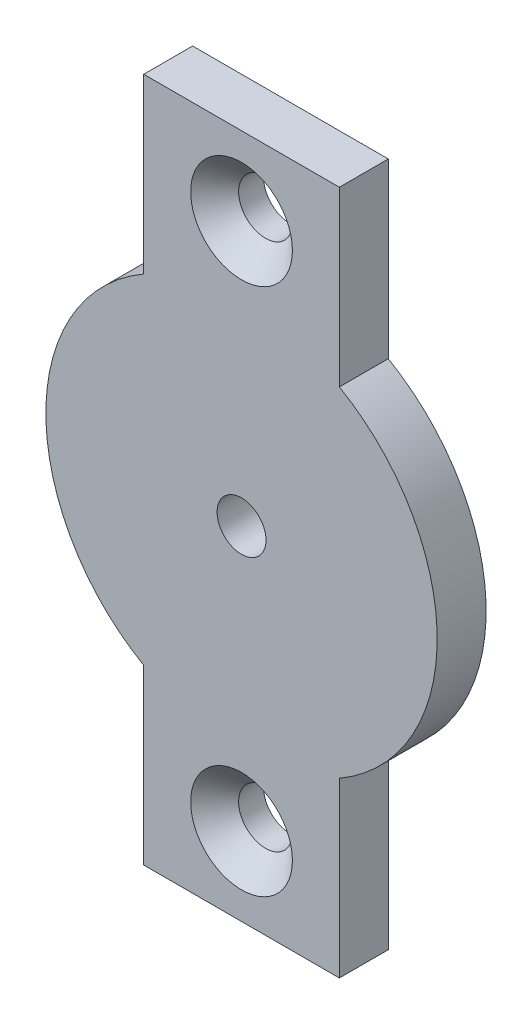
ISO-10303-21;
HEADER;
FILE_DESCRIPTION(('STEP AP214'),'2;1');
FILE_NAME('part.step','',(''),(''),'','','');
FILE_SCHEMA(('AUTOMOTIVE_DESIGN { 1 0 10303 214 1 1 1 1 }'));
ENDSEC;
DATA;
#1=APPLICATION_CONTEXT('core data for automotive mechanical design processes');
#2=APPLICATION_PROTOCOL_DEFINITION('international standard','automotive_design',2000,#1);
#3=PRODUCT_CONTEXT('',#1,'mechanical');
#4=PRODUCT('Part','Part','',(#3));
#5=PRODUCT_RELATED_PRODUCT_CATEGORY('part','',(#4));
#6=PRODUCT_DEFINITION_FORMATION('','',#4);
#7=PRODUCT_DEFINITION_CONTEXT('part definition',#1,'design');
#8=PRODUCT_DEFINITION('design','',#6,#7);
#9=PRODUCT_DEFINITION_SHAPE('','',#8);
#10=(LENGTH_UNIT() NAMED_UNIT(*) SI_UNIT(.MILLI.,.METRE.));
#11=(NAMED_UNIT(*) PLANE_ANGLE_UNIT() SI_UNIT($,.RADIAN.));
#12=(NAMED_UNIT(*) SI_UNIT($,.STERADIAN.) SOLID_ANGLE_UNIT());
#13=UNCERTAINTY_MEASURE_WITH_UNIT(LENGTH_MEASURE(1.E-05),#10,'distance_accuracy_value','');
#14=(GEOMETRIC_REPRESENTATION_CONTEXT(3) GLOBAL_UNCERTAINTY_ASSIGNED_CONTEXT((#13)) GLOBAL_UNIT_ASSIGNED_CONTEXT((#10,
#11,#12)) REPRESENTATION_CONTEXT('',''));
#15=CARTESIAN_POINT('',(0.,0.,0.));
#16=DIRECTION('',(0.,0.,1.));
#17=DIRECTION('',(1.,0.,0.));
#18=AXIS2_PLACEMENT_3D('',#15,#16,#17);
#19=CARTESIAN_POINT('',(0.,0.,5.));
#20=DIRECTION('',(0.,0.,-1.));
#21=DIRECTION('',(-1.,0.,0.));
#22=AXIS2_PLACEMENT_3D('',#19,#20,#21);
#23=CYLINDRICAL_SURFACE('',#22,20.);
#24=DIRECTION('',(0.,0.,1.));
#25=VECTOR('',#24,1.);
#26=CARTESIAN_POINT('',(-10.,-17.3205080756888,0.));
#27=LINE('',#26,#25);
#28=CARTESIAN_POINT('',(-10.,-17.3205080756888,0.));
#29=VERTEX_POINT('',#28);
#30=CARTESIAN_POINT('',(-10.,-17.3205080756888,5.));
#31=VERTEX_POINT('',#30);
#32=EDGE_CURVE('E126',#29,#31,#27,.T.);
#33=ORIENTED_EDGE('',*,*,#32,.T.);
#34=CARTESIAN_POINT('',(0.,0.,5.));
#35=DIRECTION('',(0.,0.,1.));
#36=DIRECTION('',(1.,0.,0.));
#37=AXIS2_PLACEMENT_3D('',#34,#35,#36);
#38=CIRCLE('',#37,20.);
#39=CARTESIAN_POINT('',(-10.,17.3205080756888,5.));
#40=VERTEX_POINT('',#39);
#41=EDGE_CURVE('E11',#40,#31,#38,.T.);
#42=ORIENTED_EDGE('',*,*,#41,.F.);
#43=DIRECTION('',(0.,0.,1.));
#44=VECTOR('',#43,1.);
#45=CARTESIAN_POINT('',(-10.,17.3205080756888,0.));
#46=LINE('',#45,#44);
#47=CARTESIAN_POINT('',(-10.,17.3205080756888,0.));
#48=VERTEX_POINT('',#47);
#49=EDGE_CURVE('E152',#48,#40,#46,.T.);
#50=ORIENTED_EDGE('',*,*,#49,.F.);
#51=CARTESIAN_POINT('',(0.,0.,0.));
#52=DIRECTION('',(0.,0.,1.));
#53=DIRECTION('',(1.,0.,0.));
#54=AXIS2_PLACEMENT_3D('',#51,#52,#53);
#55=CIRCLE('',#54,20.);
#56=EDGE_CURVE('E167',#48,#29,#55,.T.);
#57=ORIENTED_EDGE('',*,*,#56,.T.);
#58=EDGE_LOOP('',(#33,#42,#50,#57));
#59=FACE_BOUND('',#58,.T.);
#60=ADVANCED_FACE('F38',(#59),#23,.T.);
#61=DIRECTION('',(0.,0.,1.));
#62=VECTOR('',#61,1.);
#63=CARTESIAN_POINT('',(10.,-17.3205080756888,0.));
#64=LINE('',#63,#62);
#65=CARTESIAN_POINT('',(10.,-17.3205080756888,0.));
#66=VERTEX_POINT('',#65);
#67=CARTESIAN_POINT('',(10.,-17.3205080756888,5.));
#68=VERTEX_POINT('',#67);
#69=EDGE_CURVE('E140',#66,#68,#64,.T.);
#70=ORIENTED_EDGE('',*,*,#69,.F.);
#71=CARTESIAN_POINT('',(10.,17.3205080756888,0.));
#72=VERTEX_POINT('',#71);
#73=EDGE_CURVE('E160',#66,#72,#55,.T.);
#74=ORIENTED_EDGE('',*,*,#73,.T.);
#75=DIRECTION('',(0.,0.,1.));
#76=VECTOR('',#75,1.);
#77=CARTESIAN_POINT('',(10.,17.3205080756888,0.));
#78=LINE('',#77,#76);
#79=CARTESIAN_POINT('',(10.,17.3205080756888,5.));
#80=VERTEX_POINT('',#79);
#81=EDGE_CURVE('E163',#72,#80,#78,.T.);
#82=ORIENTED_EDGE('',*,*,#81,.T.);
#83=EDGE_CURVE('E46',#68,#80,#38,.T.);
#84=ORIENTED_EDGE('',*,*,#83,.F.);
#85=EDGE_LOOP('',(#70,#74,#82,#84));
#86=FACE_BOUND('',#85,.T.);
#87=ADVANCED_FACE('F195',(#86),#23,.T.);
#88=CARTESIAN_POINT('',(0.,0.,5.));
#89=DIRECTION('',(0.,0.,1.));
#90=DIRECTION('',(1.,0.,0.));
#91=AXIS2_PLACEMENT_3D('',#88,#89,#90);
#92=PLANE('',#91);
#93=CARTESIAN_POINT('',(0.,-27.,5.));
#94=DIRECTION('',(0.,0.,1.));
#95=DIRECTION('',(1.,0.,0.));
#96=AXIS2_PLACEMENT_3D('',#93,#94,#95);
#97=CIRCLE('',#96,5.2);
#98=CARTESIAN_POINT('',(5.20000000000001,-27.,5.));
#99=VERTEX_POINT('',#98);
#100=EDGE_CURVE('E186',#99,#99,#97,.T.);
#101=ORIENTED_EDGE('',*,*,#100,.F.);
#102=EDGE_LOOP('',(#101));
#103=FACE_BOUND('',#102,.T.);
#104=CARTESIAN_POINT('',(0.,27.,5.));
#105=DIRECTION('',(0.,0.,1.));
#106=DIRECTION('',(1.,0.,0.));
#107=AXIS2_PLACEMENT_3D('',#104,#105,#106);
#108=CIRCLE('',#107,5.2);
#109=CARTESIAN_POINT('',(5.2,27.,5.));
#110=VERTEX_POINT('',#109);
#111=EDGE_CURVE('E177',#110,#110,#108,.T.);
#112=ORIENTED_EDGE('',*,*,#111,.F.);
#113=EDGE_LOOP('',(#112));
#114=FACE_BOUND('',#113,.T.);
#115=CARTESIAN_POINT('',(0.,0.,5.));
#116=DIRECTION('',(0.,0.,1.));
#117=DIRECTION('',(1.,0.,0.));
#118=AXIS2_PLACEMENT_3D('',#115,#116,#117);
#119=CIRCLE('',#118,2.5);
#120=CARTESIAN_POINT('',(2.5,0.,5.));
#121=VERTEX_POINT('',#120);
#122=EDGE_CURVE('E131',#121,#121,#119,.T.);
#123=ORIENTED_EDGE('',*,*,#122,.F.);
#124=EDGE_LOOP('',(#123));
#125=FACE_BOUND('',#124,.T.);
#126=ORIENTED_EDGE('',*,*,#41,.T.);
#127=DIRECTION('',(0.,1.,0.));
#128=VECTOR('',#127,1.);
#129=CARTESIAN_POINT('',(-10.,-17.3205080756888,5.));
#130=LINE('',#129,#128);
#131=CARTESIAN_POINT('',(-10.,-35.,5.));
#132=VERTEX_POINT('',#131);
#133=EDGE_CURVE('E135',#132,#31,#130,.T.);
#134=ORIENTED_EDGE('',*,*,#133,.F.);
#135=DIRECTION('',(-1.,0.,0.));
#136=VECTOR('',#135,1.);
#137=CARTESIAN_POINT('',(-10.,-35.,5.));
#138=LINE('',#137,#136);
#139=CARTESIAN_POINT('',(10.,-35.,5.));
#140=VERTEX_POINT('',#139);
#141=EDGE_CURVE('E119',#140,#132,#138,.T.);
#142=ORIENTED_EDGE('',*,*,#141,.F.);
#143=DIRECTION('',(0.,-1.,0.));
#144=VECTOR('',#143,1.);
#145=CARTESIAN_POINT('',(10.,-35.,5.));
#146=LINE('',#145,#144);
#147=EDGE_CURVE('E54',#68,#140,#146,.T.);
#148=ORIENTED_EDGE('',*,*,#147,.F.);
#149=ORIENTED_EDGE('',*,*,#83,.T.);
#150=DIRECTION('',(0.,1.,0.));
#151=VECTOR('',#150,1.);
#152=CARTESIAN_POINT('',(10.,35.,5.));
#153=LINE('',#152,#151);
#154=CARTESIAN_POINT('',(10.,35.,5.));
#155=VERTEX_POINT('',#154);
#156=EDGE_CURVE('E154',#80,#155,#153,.T.);
#157=ORIENTED_EDGE('',*,*,#156,.T.);
#158=DIRECTION('',(-1.,0.,0.));
#159=VECTOR('',#158,1.);
#160=CARTESIAN_POINT('',(-10.,35.,5.));
#161=LINE('',#160,#159);
#162=CARTESIAN_POINT('',(-10.,35.,5.));
#163=VERTEX_POINT('',#162);
#164=EDGE_CURVE('E146',#155,#163,#161,.T.);
#165=ORIENTED_EDGE('',*,*,#164,.T.);
#166=DIRECTION('',(0.,-1.,0.));
#167=VECTOR('',#166,1.);
#168=CARTESIAN_POINT('',(-10.,17.3205080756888,5.));
#169=LINE('',#168,#167);
#170=EDGE_CURVE('E60',#163,#40,#169,.T.);
#171=ORIENTED_EDGE('',*,*,#170,.T.);
#172=EDGE_LOOP('',(#126,#134,#142,#148,#149,#157,#165,#171));
#173=FACE_BOUND('',#172,.T.);
#174=ADVANCED_FACE('F192',(#103,#114,#125,#173),#92,.T.);
#175=CARTESIAN_POINT('',(0.,0.,0.));
#176=DIRECTION('',(0.,0.,1.));
#177=DIRECTION('',(1.,0.,0.));
#178=AXIS2_PLACEMENT_3D('',#175,#176,#177);
#179=PLANE('',#178);
#180=CARTESIAN_POINT('',(0.,-27.,0.));
#181=DIRECTION('',(0.,0.,1.));
#182=DIRECTION('',(1.,0.,0.));
#183=AXIS2_PLACEMENT_3D('',#180,#181,#182);
#184=CIRCLE('',#183,2.75);
#185=CARTESIAN_POINT('',(2.75000000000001,-27.,0.));
#186=VERTEX_POINT('',#185);
#187=EDGE_CURVE('E41',#186,#186,#184,.T.);
#188=ORIENTED_EDGE('',*,*,#187,.T.);
#189=EDGE_LOOP('',(#188));
#190=FACE_BOUND('',#189,.T.);
#191=CARTESIAN_POINT('',(0.,27.,0.));
#192=DIRECTION('',(0.,0.,1.));
#193=DIRECTION('',(1.,0.,0.));
#194=AXIS2_PLACEMENT_3D('',#191,#192,#193);
#195=CIRCLE('',#194,2.75);
#196=CARTESIAN_POINT('',(2.75,27.,0.));
#197=VERTEX_POINT('',#196);
#198=EDGE_CURVE('E170',#197,#197,#195,.T.);
#199=ORIENTED_EDGE('',*,*,#198,.T.);
#200=EDGE_LOOP('',(#199));
#201=FACE_BOUND('',#200,.T.);
#202=CARTESIAN_POINT('',(0.,0.,0.));
#203=DIRECTION('',(0.,0.,1.));
#204=DIRECTION('',(1.,0.,0.));
#205=AXIS2_PLACEMENT_3D('',#202,#203,#204);
#206=CIRCLE('',#205,2.5);
#207=CARTESIAN_POINT('',(2.5,0.,0.));
#208=VERTEX_POINT('',#207);
#209=EDGE_CURVE('E137',#208,#208,#206,.T.);
#210=ORIENTED_EDGE('',*,*,#209,.T.);
#211=EDGE_LOOP('',(#210));
#212=FACE_BOUND('',#211,.T.);
#213=ORIENTED_EDGE('',*,*,#73,.F.);
#214=DIRECTION('',(0.,-1.,0.));
#215=VECTOR('',#214,1.);
#216=CARTESIAN_POINT('',(10.,-35.,0.));
#217=LINE('',#216,#215);
#218=CARTESIAN_POINT('',(10.,-35.,0.));
#219=VERTEX_POINT('',#218);
#220=EDGE_CURVE('E111',#66,#219,#217,.T.);
#221=ORIENTED_EDGE('',*,*,#220,.T.);
#222=DIRECTION('',(-1.,0.,0.));
#223=VECTOR('',#222,1.);
#224=CARTESIAN_POINT('',(-10.,-35.,0.));
#225=LINE('',#224,#223);
#226=CARTESIAN_POINT('',(-10.,-35.,0.));
#227=VERTEX_POINT('',#226);
#228=EDGE_CURVE('E103',#219,#227,#225,.T.);
#229=ORIENTED_EDGE('',*,*,#228,.T.);
#230=DIRECTION('',(0.,1.,0.));
#231=VECTOR('',#230,1.);
#232=CARTESIAN_POINT('',(-10.,-17.3205080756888,0.));
#233=LINE('',#232,#231);
#234=EDGE_CURVE('E109',#227,#29,#233,.T.);
#235=ORIENTED_EDGE('',*,*,#234,.T.);
#236=ORIENTED_EDGE('',*,*,#56,.F.);
#237=DIRECTION('',(0.,-1.,0.));
#238=VECTOR('',#237,1.);
#239=CARTESIAN_POINT('',(-10.,17.3205080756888,0.));
#240=LINE('',#239,#238);
#241=CARTESIAN_POINT('',(-10.,35.,0.));
#242=VERTEX_POINT('',#241);
#243=EDGE_CURVE('E143',#242,#48,#240,.T.);
#244=ORIENTED_EDGE('',*,*,#243,.F.);
#245=DIRECTION('',(-1.,0.,0.));
#246=VECTOR('',#245,1.);
#247=CARTESIAN_POINT('',(-10.,35.,0.));
#248=LINE('',#247,#246);
#249=CARTESIAN_POINT('',(10.,35.,0.));
#250=VERTEX_POINT('',#249);
#251=EDGE_CURVE('E149',#250,#242,#248,.T.);
#252=ORIENTED_EDGE('',*,*,#251,.F.);
#253=DIRECTION('',(0.,1.,0.));
#254=VECTOR('',#253,1.);
#255=CARTESIAN_POINT('',(10.,35.,0.));
#256=LINE('',#255,#254);
#257=EDGE_CURVE('E145',#72,#250,#256,.T.);
#258=ORIENTED_EDGE('',*,*,#257,.F.);
#259=EDGE_LOOP('',(#213,#221,#229,#235,#236,#244,#252,#258));
#260=FACE_BOUND('',#259,.T.);
#261=ADVANCED_FACE('F106',(#190,#201,#212,#260),#179,.F.);
#262=CARTESIAN_POINT('',(-10.,17.3205080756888,0.));
#263=DIRECTION('',(-1.,0.,0.));
#264=DIRECTION('',(0.,0.,1.));
#265=AXIS2_PLACEMENT_3D('',#262,#263,#264);
#266=PLANE('',#265);
#267=ORIENTED_EDGE('',*,*,#170,.F.);
#268=DIRECTION('',(0.,0.,1.));
#269=VECTOR('',#268,1.);
#270=CARTESIAN_POINT('',(-10.,35.,0.));
#271=LINE('',#270,#269);
#272=EDGE_CURVE('E158',#242,#163,#271,.T.);
#273=ORIENTED_EDGE('',*,*,#272,.F.);
#274=ORIENTED_EDGE('',*,*,#243,.T.);
#275=ORIENTED_EDGE('',*,*,#49,.T.);
#276=EDGE_LOOP('',(#267,#273,#274,#275));
#277=FACE_BOUND('',#276,.T.);
#278=ADVANCED_FACE('F247',(#277),#266,.T.);
#279=CARTESIAN_POINT('',(-10.,35.,0.));
#280=DIRECTION('',(0.,1.,0.));
#281=DIRECTION('',(0.,0.,1.));
#282=AXIS2_PLACEMENT_3D('',#279,#280,#281);
#283=PLANE('',#282);
#284=ORIENTED_EDGE('',*,*,#164,.F.);
#285=DIRECTION('',(0.,0.,1.));
#286=VECTOR('',#285,1.);
#287=CARTESIAN_POINT('',(10.,35.,0.));
#288=LINE('',#287,#286);
#289=EDGE_CURVE('E161',#250,#155,#288,.T.);
#290=ORIENTED_EDGE('',*,*,#289,.F.);
#291=ORIENTED_EDGE('',*,*,#251,.T.);
#292=ORIENTED_EDGE('',*,*,#272,.T.);
#293=EDGE_LOOP('',(#284,#290,#291,#292));
#294=FACE_BOUND('',#293,.T.);
#295=ADVANCED_FACE('F209',(#294),#283,.T.);
#296=CARTESIAN_POINT('',(10.,35.,0.));
#297=DIRECTION('',(1.,0.,0.));
#298=DIRECTION('',(0.,0.,-1.));
#299=AXIS2_PLACEMENT_3D('',#296,#297,#298);
#300=PLANE('',#299);
#301=ORIENTED_EDGE('',*,*,#156,.F.);
#302=ORIENTED_EDGE('',*,*,#81,.F.);
#303=ORIENTED_EDGE('',*,*,#257,.T.);
#304=ORIENTED_EDGE('',*,*,#289,.T.);
#305=EDGE_LOOP('',(#301,#302,#303,#304));
#306=FACE_BOUND('',#305,.T.);
#307=ADVANCED_FACE('F213',(#306),#300,.T.);
#308=CARTESIAN_POINT('',(-10.,-17.3205080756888,0.));
#309=DIRECTION('',(1.,0.,0.));
#310=DIRECTION('',(0.,0.,-1.));
#311=AXIS2_PLACEMENT_3D('',#308,#309,#310);
#312=PLANE('',#311);
#313=ORIENTED_EDGE('',*,*,#133,.T.);
#314=ORIENTED_EDGE('',*,*,#32,.F.);
#315=ORIENTED_EDGE('',*,*,#234,.F.);
#316=DIRECTION('',(0.,0.,1.));
#317=VECTOR('',#316,1.);
#318=CARTESIAN_POINT('',(-10.,-35.,0.));
#319=LINE('',#318,#317);
#320=EDGE_CURVE('E117',#227,#132,#319,.T.);
#321=ORIENTED_EDGE('',*,*,#320,.T.);
#322=EDGE_LOOP('',(#313,#314,#315,#321));
#323=FACE_BOUND('',#322,.T.);
#324=ADVANCED_FACE('F124',(#323),#312,.F.);
#325=CARTESIAN_POINT('',(10.,-35.,0.));
#326=DIRECTION('',(-1.,0.,0.));
#327=DIRECTION('',(0.,0.,1.));
#328=AXIS2_PLACEMENT_3D('',#325,#326,#327);
#329=PLANE('',#328);
#330=ORIENTED_EDGE('',*,*,#147,.T.);
#331=DIRECTION('',(0.,0.,1.));
#332=VECTOR('',#331,1.);
#333=CARTESIAN_POINT('',(10.,-35.,0.));
#334=LINE('',#333,#332);
#335=EDGE_CURVE('E122',#219,#140,#334,.T.);
#336=ORIENTED_EDGE('',*,*,#335,.F.);
#337=ORIENTED_EDGE('',*,*,#220,.F.);
#338=ORIENTED_EDGE('',*,*,#69,.T.);
#339=EDGE_LOOP('',(#330,#336,#337,#338));
#340=FACE_BOUND('',#339,.T.);
#341=ADVANCED_FACE('F218',(#340),#329,.F.);
#342=CARTESIAN_POINT('',(-10.,-35.,0.));
#343=DIRECTION('',(0.,1.,0.));
#344=DIRECTION('',(0.,0.,1.));
#345=AXIS2_PLACEMENT_3D('',#342,#343,#344);
#346=PLANE('',#345);
#347=ORIENTED_EDGE('',*,*,#141,.T.);
#348=ORIENTED_EDGE('',*,*,#320,.F.);
#349=ORIENTED_EDGE('',*,*,#228,.F.);
#350=ORIENTED_EDGE('',*,*,#335,.T.);
#351=EDGE_LOOP('',(#347,#348,#349,#350));
#352=FACE_BOUND('',#351,.T.);
#353=ADVANCED_FACE('F118',(#352),#346,.F.);
#354=CARTESIAN_POINT('',(0.,0.,-5.));
#355=DIRECTION('',(0.,0.,1.));
#356=DIRECTION('',(1.,0.,0.));
#357=AXIS2_PLACEMENT_3D('',#354,#355,#356);
#358=CYLINDRICAL_SURFACE('',#357,2.5);
#359=ORIENTED_EDGE('',*,*,#122,.T.);
#360=EDGE_LOOP('',(#359));
#361=FACE_BOUND('',#360,.T.);
#362=ORIENTED_EDGE('',*,*,#209,.F.);
#363=EDGE_LOOP('',(#362));
#364=FACE_BOUND('',#363,.T.);
#365=ADVANCED_FACE('F225',(#361,#364),#358,.F.);
#366=CARTESIAN_POINT('',(0.,27.,5.));
#367=DIRECTION('',(0.,0.,1.));
#368=DIRECTION('',(1.,0.,0.));
#369=AXIS2_PLACEMENT_3D('',#366,#367,#368);
#370=CYLINDRICAL_SURFACE('',#369,2.75);
#371=CARTESIAN_POINT('',(0.,27.,2.55));
#372=DIRECTION('',(0.,0.,1.));
#373=DIRECTION('',(1.,0.,0.));
#374=AXIS2_PLACEMENT_3D('',#371,#372,#373);
#375=CIRCLE('',#374,2.75);
#376=CARTESIAN_POINT('',(2.75,27.,2.55));
#377=VERTEX_POINT('',#376);
#378=EDGE_CURVE('E172',#377,#377,#375,.T.);
#379=ORIENTED_EDGE('',*,*,#378,.T.);
#380=EDGE_LOOP('',(#379));
#381=FACE_BOUND('',#380,.T.);
#382=ORIENTED_EDGE('',*,*,#198,.F.);
#383=EDGE_LOOP('',(#382));
#384=FACE_BOUND('',#383,.T.);
#385=ADVANCED_FACE('F287',(#381,#384),#370,.F.);
#386=CARTESIAN_POINT('',(0.,27.,5.));
#387=DIRECTION('',(0.,0.,1.));
#388=DIRECTION('',(1.,0.,0.));
#389=AXIS2_PLACEMENT_3D('',#386,#387,#388);
#390=CONICAL_SURFACE('',#389,5.2,0.785398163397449);
#391=ORIENTED_EDGE('',*,*,#378,.F.);
#392=EDGE_LOOP('',(#391));
#393=FACE_BOUND('',#392,.T.);
#394=ORIENTED_EDGE('',*,*,#111,.T.);
#395=EDGE_LOOP('',(#394));
#396=FACE_BOUND('',#395,.T.);
#397=ADVANCED_FACE('F296',(#393,#396),#390,.F.);
#398=CARTESIAN_POINT('',(0.,-27.,5.));
#399=DIRECTION('',(0.,0.,1.));
#400=DIRECTION('',(1.,0.,0.));
#401=AXIS2_PLACEMENT_3D('',#398,#399,#400);
#402=CYLINDRICAL_SURFACE('',#401,2.75);
#403=CARTESIAN_POINT('',(0.,-27.,2.55));
#404=DIRECTION('',(0.,0.,1.));
#405=DIRECTION('',(1.,0.,0.));
#406=AXIS2_PLACEMENT_3D('',#403,#404,#405);
#407=CIRCLE('',#406,2.75);
#408=CARTESIAN_POINT('',(2.75000000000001,-27.,2.55));
#409=VERTEX_POINT('',#408);
#410=EDGE_CURVE('E183',#409,#409,#407,.T.);
#411=ORIENTED_EDGE('',*,*,#410,.T.);
#412=EDGE_LOOP('',(#411));
#413=FACE_BOUND('',#412,.T.);
#414=ORIENTED_EDGE('',*,*,#187,.F.);
#415=EDGE_LOOP('',(#414));
#416=FACE_BOUND('',#415,.T.);
#417=ADVANCED_FACE('F302',(#413,#416),#402,.F.);
#418=CARTESIAN_POINT('',(0.,-27.,5.));
#419=DIRECTION('',(0.,0.,1.));
#420=DIRECTION('',(1.,0.,0.));
#421=AXIS2_PLACEMENT_3D('',#418,#419,#420);
#422=CONICAL_SURFACE('',#421,5.2,0.785398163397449);
#423=ORIENTED_EDGE('',*,*,#410,.F.);
#424=EDGE_LOOP('',(#423));
#425=FACE_BOUND('',#424,.T.);
#426=ORIENTED_EDGE('',*,*,#100,.T.);
#427=EDGE_LOOP('',(#426));
#428=FACE_BOUND('',#427,.T.);
#429=ADVANCED_FACE('F190',(#425,#428),#422,.F.);
#430=CLOSED_SHELL('',(#60,#87,#174,#261,#278,#295,#307,#324,#341,#353,#365,#385,#397,#417,#429));
#431=MANIFOLD_SOLID_BREP('B2',#430);
#432=ADVANCED_BREP_SHAPE_REPRESENTATION('',(#18,#431),#14);
#433=SHAPE_DEFINITION_REPRESENTATION(#9,#432);
ENDSEC;
END-ISO-10303-21;
